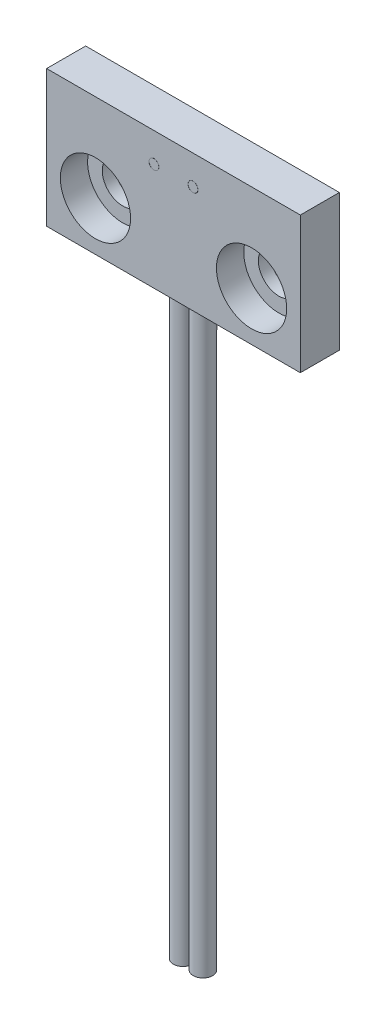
from build123d import *

# Parameters (mm, degrees)
SKETCH_1_W                = 13
SKETCH_1_H                = 7
EXTRUDE_1_DEPTH           = 1
HOLE_WIZARD_1_D           = 2.1
HOLE_WIZARD_1_CBORE_D     = 3.6
HOLE_WIZARD_1_CBORE_DEPTH = 1.4
SKETCH_9_R                = 0.5
EXTRUDE_2_DEPTH           = 30
SKETCH_8_R                = 0.255
SKETCH_8_R_2              = 0.25
CUT_EXTRUDE_1_DEPTH       = 0.1


with BuildPart() as part:
    # Sketch 1 → Extrude 1 (new, symmetric)
    with BuildSketch(Plane.XY):
        Rectangle(SKETCH_1_W, SKETCH_1_H)
    extrude(amount=EXTRUDE_1_DEPTH, both=True)

    # Hole Wizard 1 (through all)
    with Locations(Plane.XY.offset(1)):
        with Locations((-4, -1), (4, -1)):
            CounterBoreHole(HOLE_WIZARD_1_D / 2, HOLE_WIZARD_1_CBORE_D / 2, HOLE_WIZARD_1_CBORE_DEPTH)

    # Sketch 9 → Extrude 2 (add)
    with BuildSketch(Plane.XZ.offset(3.5)):
        with Locations(Location((0.51, 0, 0), (0, 0, 180))):
            Circle(SKETCH_9_R)
        with Locations(Location((-0.51, 0, 0), (0, 0, 180))):
            Circle(SKETCH_9_R)
    extrude(amount=EXTRUDE_2_DEPTH)

    # Sketch 8 → Cut-Extrude 1 (cut)
    # profile 1 of 2: a face of its own
    with BuildSketch(Plane.XY.offset(1)):
        with Locations((-1, 2)):
            Circle(SKETCH_8_R)
        with Locations((-1, 2)):
            Circle(SKETCH_8_R_2, mode=Mode.SUBTRACT)
    # profile 2 of 2: a face of its own
    with BuildSketch(Plane.XY.offset(1)):
        with Locations((1, 2)):
            Circle(SKETCH_8_R)
        with Locations((1, 2)):
            Circle(SKETCH_8_R_2, mode=Mode.SUBTRACT)
    extrude(amount=-CUT_EXTRUDE_1_DEPTH, mode=Mode.SUBTRACT)


solid = part.part
